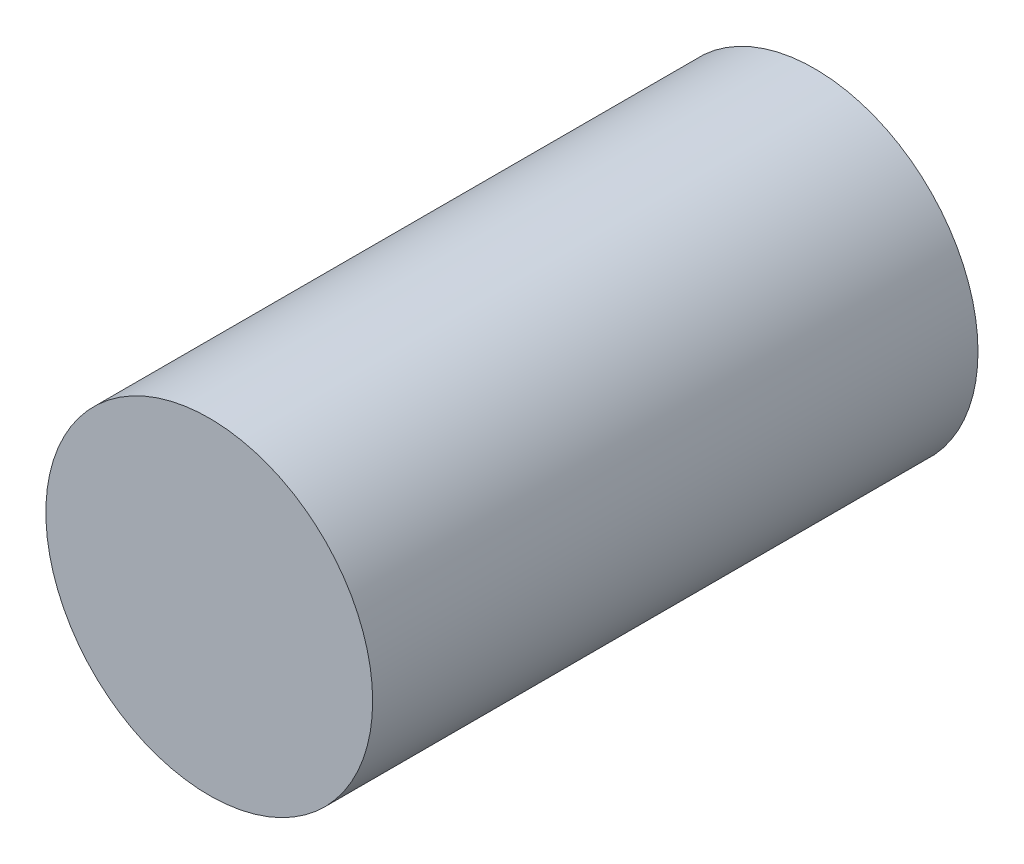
ISO-10303-21;
HEADER;
FILE_DESCRIPTION(('STEP AP214'),'2;1');
FILE_NAME('part.step','',(''),(''),'','','');
FILE_SCHEMA(('AUTOMOTIVE_DESIGN { 1 0 10303 214 1 1 1 1 }'));
ENDSEC;
DATA;
#1=APPLICATION_CONTEXT('core data for automotive mechanical design processes');
#2=APPLICATION_PROTOCOL_DEFINITION('international standard','automotive_design',2000,#1);
#3=PRODUCT_CONTEXT('',#1,'mechanical');
#4=PRODUCT('Part','Part','',(#3));
#5=PRODUCT_RELATED_PRODUCT_CATEGORY('part','',(#4));
#6=PRODUCT_DEFINITION_FORMATION('','',#4);
#7=PRODUCT_DEFINITION_CONTEXT('part definition',#1,'design');
#8=PRODUCT_DEFINITION('design','',#6,#7);
#9=PRODUCT_DEFINITION_SHAPE('','',#8);
#10=(LENGTH_UNIT() NAMED_UNIT(*) SI_UNIT(.MILLI.,.METRE.));
#11=(NAMED_UNIT(*) PLANE_ANGLE_UNIT() SI_UNIT($,.RADIAN.));
#12=(NAMED_UNIT(*) SI_UNIT($,.STERADIAN.) SOLID_ANGLE_UNIT());
#13=UNCERTAINTY_MEASURE_WITH_UNIT(LENGTH_MEASURE(1.E-05),#10,'distance_accuracy_value','');
#14=(GEOMETRIC_REPRESENTATION_CONTEXT(3) GLOBAL_UNCERTAINTY_ASSIGNED_CONTEXT((#13)) GLOBAL_UNIT_ASSIGNED_CONTEXT((#10,
#11,#12)) REPRESENTATION_CONTEXT('',''));
#15=CARTESIAN_POINT('',(0.,0.,0.));
#16=DIRECTION('',(0.,0.,1.));
#17=DIRECTION('',(1.,0.,0.));
#18=AXIS2_PLACEMENT_3D('',#15,#16,#17);
#19=CARTESIAN_POINT('',(1.52907225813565E-13,0.,-539.302659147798));
#20=DIRECTION('',(0.,0.,1.));
#21=DIRECTION('',(1.,0.,0.));
#22=AXIS2_PLACEMENT_3D('',#19,#20,#21);
#23=CYLINDRICAL_SURFACE('',#22,82.55);
#24=CARTESIAN_POINT('',(1.52907225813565E-13,0.,-305.816));
#25=DIRECTION('',(0.,0.,1.));
#26=DIRECTION('',(0.,-1.,0.));
#27=AXIS2_PLACEMENT_3D('',#24,#25,#26);
#28=CIRCLE('',#27,82.55);
#29=CARTESIAN_POINT('',(1.52907225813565E-13,-82.5499999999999,-305.816));
#30=VERTEX_POINT('',#29);
#31=EDGE_CURVE('E10',#30,#30,#28,.F.);
#32=ORIENTED_EDGE('',*,*,#31,.F.);
#33=EDGE_LOOP('',(#32));
#34=FACE_BOUND('',#33,.T.);
#35=CARTESIAN_POINT('',(1.52907225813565E-13,0.,0.));
#36=DIRECTION('',(0.,0.,1.));
#37=DIRECTION('',(1.,0.,0.));
#38=AXIS2_PLACEMENT_3D('',#35,#36,#37);
#39=CIRCLE('',#38,82.55);
#40=CARTESIAN_POINT('',(82.5500000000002,0.,0.));
#41=VERTEX_POINT('',#40);
#42=EDGE_CURVE('E39',#41,#41,#39,.T.);
#43=ORIENTED_EDGE('',*,*,#42,.F.);
#44=EDGE_LOOP('',(#43));
#45=FACE_BOUND('',#44,.T.);
#46=ADVANCED_FACE('F33',(#34,#45),#23,.T.);
#47=CARTESIAN_POINT('',(1.52907225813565E-13,0.,0.));
#48=DIRECTION('',(0.,0.,1.));
#49=DIRECTION('',(1.,0.,0.));
#50=AXIS2_PLACEMENT_3D('',#47,#48,#49);
#51=PLANE('',#50);
#52=ORIENTED_EDGE('',*,*,#42,.T.);
#53=EDGE_LOOP('',(#52));
#54=FACE_BOUND('',#53,.T.);
#55=ADVANCED_FACE('F45',(#54),#51,.T.);
#56=CARTESIAN_POINT('',(-85.725,85.725,-305.816));
#57=DIRECTION('',(0.,0.,1.));
#58=DIRECTION('',(0.,1.,0.));
#59=AXIS2_PLACEMENT_3D('',#56,#57,#58);
#60=PLANE('',#59);
#61=ORIENTED_EDGE('',*,*,#31,.T.);
#62=EDGE_LOOP('',(#61));
#63=FACE_BOUND('',#62,.T.);
#64=ADVANCED_FACE('F52',(#63),#60,.F.);
#65=CLOSED_SHELL('',(#46,#55,#64));
#66=MANIFOLD_SOLID_BREP('B2',#65);
#67=ADVANCED_BREP_SHAPE_REPRESENTATION('',(#18,#66),#14);
#68=SHAPE_DEFINITION_REPRESENTATION(#9,#67);
ENDSEC;
END-ISO-10303-21;
